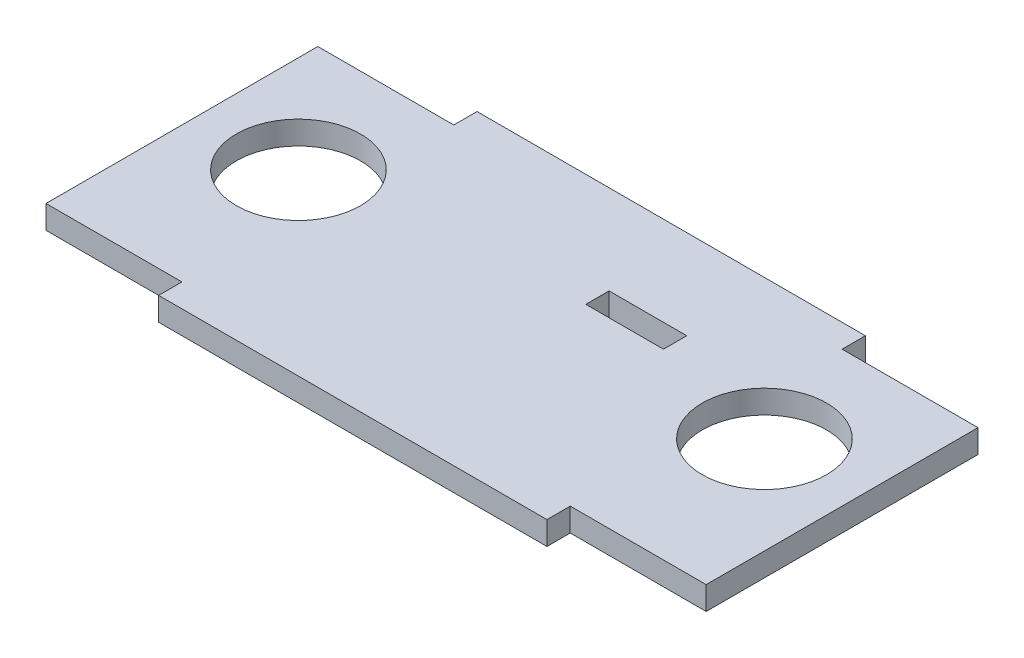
ISO-10303-21;
HEADER;
FILE_DESCRIPTION(('STEP AP214'),'2;1');
FILE_NAME('part.step','',(''),(''),'','','');
FILE_SCHEMA(('AUTOMOTIVE_DESIGN { 1 0 10303 214 1 1 1 1 }'));
ENDSEC;
DATA;
#1=APPLICATION_CONTEXT('core data for automotive mechanical design processes');
#2=APPLICATION_PROTOCOL_DEFINITION('international standard','automotive_design',2000,#1);
#3=PRODUCT_CONTEXT('',#1,'mechanical');
#4=PRODUCT('Part','Part','',(#3));
#5=PRODUCT_RELATED_PRODUCT_CATEGORY('part','',(#4));
#6=PRODUCT_DEFINITION_FORMATION('','',#4);
#7=PRODUCT_DEFINITION_CONTEXT('part definition',#1,'design');
#8=PRODUCT_DEFINITION('design','',#6,#7);
#9=PRODUCT_DEFINITION_SHAPE('','',#8);
#10=(LENGTH_UNIT() NAMED_UNIT(*) SI_UNIT(.MILLI.,.METRE.));
#11=(NAMED_UNIT(*) PLANE_ANGLE_UNIT() SI_UNIT($,.RADIAN.));
#12=(NAMED_UNIT(*) SI_UNIT($,.STERADIAN.) SOLID_ANGLE_UNIT());
#13=UNCERTAINTY_MEASURE_WITH_UNIT(LENGTH_MEASURE(1.E-05),#10,'distance_accuracy_value','');
#14=(GEOMETRIC_REPRESENTATION_CONTEXT(3) GLOBAL_UNCERTAINTY_ASSIGNED_CONTEXT((#13)) GLOBAL_UNIT_ASSIGNED_CONTEXT((#10,
#11,#12)) REPRESENTATION_CONTEXT('',''));
#15=CARTESIAN_POINT('',(0.,0.,0.));
#16=DIRECTION('',(0.,0.,1.));
#17=DIRECTION('',(1.,0.,0.));
#18=AXIS2_PLACEMENT_3D('',#15,#16,#17);
#19=CARTESIAN_POINT('',(0.,3.,0.));
#20=DIRECTION('',(0.,1.,0.));
#21=DIRECTION('',(0.,0.,1.));
#22=AXIS2_PLACEMENT_3D('',#19,#20,#21);
#23=PLANE('',#22);
#24=DIRECTION('',(0.,0.,-1.));
#25=VECTOR('',#24,1.);
#26=CARTESIAN_POINT('',(13.5,3.,-13.5));
#27=LINE('',#26,#25);
#28=CARTESIAN_POINT('',(13.5,3.,-10.5));
#29=VERTEX_POINT('',#28);
#30=CARTESIAN_POINT('',(13.5,3.,-13.5));
#31=VERTEX_POINT('',#30);
#32=EDGE_CURVE('E211',#29,#31,#27,.T.);
#33=ORIENTED_EDGE('',*,*,#32,.F.);
#34=DIRECTION('',(1.,0.,0.));
#35=VECTOR('',#34,1.);
#36=CARTESIAN_POINT('',(3.5,3.,-10.5));
#37=LINE('',#36,#35);
#38=CARTESIAN_POINT('',(3.5,3.,-10.5));
#39=VERTEX_POINT('',#38);
#40=EDGE_CURVE('E201',#39,#29,#37,.T.);
#41=ORIENTED_EDGE('',*,*,#40,.F.);
#42=DIRECTION('',(0.,0.,1.));
#43=VECTOR('',#42,1.);
#44=CARTESIAN_POINT('',(3.5,3.,-13.5));
#45=LINE('',#44,#43);
#46=CARTESIAN_POINT('',(3.5,3.,-13.5));
#47=VERTEX_POINT('',#46);
#48=EDGE_CURVE('E205',#47,#39,#45,.T.);
#49=ORIENTED_EDGE('',*,*,#48,.F.);
#50=DIRECTION('',(-1.,0.,0.));
#51=VECTOR('',#50,1.);
#52=CARTESIAN_POINT('',(3.5,3.,-13.5));
#53=LINE('',#52,#51);
#54=EDGE_CURVE('E208',#31,#47,#53,.T.);
#55=ORIENTED_EDGE('',*,*,#54,.F.);
#56=EDGE_LOOP('',(#33,#41,#49,#55));
#57=FACE_BOUND('',#56,.T.);
#58=CARTESIAN_POINT('',(-30.,3.,-7.00000000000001));
#59=DIRECTION('',(0.,1.,0.));
#60=DIRECTION('',(0.,0.,1.));
#61=AXIS2_PLACEMENT_3D('',#58,#59,#60);
#62=CIRCLE('',#61,8.);
#63=CARTESIAN_POINT('',(-30.,3.,0.999999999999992));
#64=VERTEX_POINT('',#63);
#65=EDGE_CURVE('E175',#64,#64,#62,.T.);
#66=ORIENTED_EDGE('',*,*,#65,.F.);
#67=EDGE_LOOP('',(#66));
#68=FACE_BOUND('',#67,.T.);
#69=CARTESIAN_POINT('',(30.,3.,-7.00000000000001));
#70=DIRECTION('',(0.,1.,0.));
#71=DIRECTION('',(0.,0.,1.));
#72=AXIS2_PLACEMENT_3D('',#69,#70,#71);
#73=CIRCLE('',#72,8.);
#74=CARTESIAN_POINT('',(30.,3.,0.999999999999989));
#75=VERTEX_POINT('',#74);
#76=EDGE_CURVE('E183',#75,#75,#73,.T.);
#77=ORIENTED_EDGE('',*,*,#76,.F.);
#78=EDGE_LOOP('',(#77));
#79=FACE_BOUND('',#78,.T.);
#80=DIRECTION('',(-1.,0.,0.));
#81=VECTOR('',#80,1.);
#82=CARTESIAN_POINT('',(0.,3.,16.));
#83=LINE('',#82,#81);
#84=CARTESIAN_POINT('',(25.,3.,16.));
#85=VERTEX_POINT('',#84);
#86=CARTESIAN_POINT('',(-25.,3.,16.));
#87=VERTEX_POINT('',#86);
#88=EDGE_CURVE('E188',#85,#87,#83,.T.);
#89=ORIENTED_EDGE('',*,*,#88,.F.);
#90=DIRECTION('',(0.,0.,-1.));
#91=VECTOR('',#90,1.);
#92=CARTESIAN_POINT('',(25.,3.,16.));
#93=LINE('',#92,#91);
#94=CARTESIAN_POINT('',(25.,3.,13.));
#95=VERTEX_POINT('',#94);
#96=EDGE_CURVE('E50',#85,#95,#93,.T.);
#97=ORIENTED_EDGE('',*,*,#96,.T.);
#98=DIRECTION('',(1.,0.,0.));
#99=VECTOR('',#98,1.);
#100=CARTESIAN_POINT('',(42.5,3.,13.));
#101=LINE('',#100,#99);
#102=CARTESIAN_POINT('',(42.5,3.,13.));
#103=VERTEX_POINT('',#102);
#104=EDGE_CURVE('E279',#95,#103,#101,.T.);
#105=ORIENTED_EDGE('',*,*,#104,.T.);
#106=DIRECTION('',(0.,0.,-1.));
#107=VECTOR('',#106,1.);
#108=CARTESIAN_POINT('',(42.5,3.,-25.));
#109=LINE('',#108,#107);
#110=CARTESIAN_POINT('',(42.5,3.,-22.));
#111=VERTEX_POINT('',#110);
#112=EDGE_CURVE('E165',#103,#111,#109,.T.);
#113=ORIENTED_EDGE('',*,*,#112,.T.);
#114=DIRECTION('',(-1.,0.,0.));
#115=VECTOR('',#114,1.);
#116=CARTESIAN_POINT('',(42.5,3.,-22.));
#117=LINE('',#116,#115);
#118=CARTESIAN_POINT('',(25.,3.,-22.));
#119=VERTEX_POINT('',#118);
#120=EDGE_CURVE('E248',#111,#119,#117,.T.);
#121=ORIENTED_EDGE('',*,*,#120,.T.);
#122=DIRECTION('',(0.,0.,-1.));
#123=VECTOR('',#122,1.);
#124=CARTESIAN_POINT('',(25.,3.,-25.));
#125=LINE('',#124,#123);
#126=CARTESIAN_POINT('',(25.,3.,-25.));
#127=VERTEX_POINT('',#126);
#128=EDGE_CURVE('E252',#119,#127,#125,.T.);
#129=ORIENTED_EDGE('',*,*,#128,.T.);
#130=DIRECTION('',(-1.,0.,0.));
#131=VECTOR('',#130,1.);
#132=CARTESIAN_POINT('',(-42.5,3.,-25.));
#133=LINE('',#132,#131);
#134=CARTESIAN_POINT('',(-25.,3.,-25.));
#135=VERTEX_POINT('',#134);
#136=EDGE_CURVE('E42',#127,#135,#133,.T.);
#137=ORIENTED_EDGE('',*,*,#136,.T.);
#138=DIRECTION('',(0.,0.,-1.));
#139=VECTOR('',#138,1.);
#140=CARTESIAN_POINT('',(-25.,3.,-25.));
#141=LINE('',#140,#139);
#142=CARTESIAN_POINT('',(-25.,3.,-22.));
#143=VERTEX_POINT('',#142);
#144=EDGE_CURVE('E231',#143,#135,#141,.T.);
#145=ORIENTED_EDGE('',*,*,#144,.F.);
#146=DIRECTION('',(1.,0.,0.));
#147=VECTOR('',#146,1.);
#148=CARTESIAN_POINT('',(-42.5,3.,-22.));
#149=LINE('',#148,#147);
#150=CARTESIAN_POINT('',(-42.5,3.,-22.));
#151=VERTEX_POINT('',#150);
#152=EDGE_CURVE('E235',#151,#143,#149,.T.);
#153=ORIENTED_EDGE('',*,*,#152,.F.);
#154=DIRECTION('',(0.,0.,1.));
#155=VECTOR('',#154,1.);
#156=CARTESIAN_POINT('',(-42.5,3.,-25.));
#157=LINE('',#156,#155);
#158=CARTESIAN_POINT('',(-42.5,3.,13.));
#159=VERTEX_POINT('',#158);
#160=EDGE_CURVE('E11',#151,#159,#157,.T.);
#161=ORIENTED_EDGE('',*,*,#160,.T.);
#162=DIRECTION('',(-1.,0.,0.));
#163=VECTOR('',#162,1.);
#164=CARTESIAN_POINT('',(-42.5,3.,13.));
#165=LINE('',#164,#163);
#166=CARTESIAN_POINT('',(-25.,3.,13.));
#167=VERTEX_POINT('',#166);
#168=EDGE_CURVE('E266',#167,#159,#165,.T.);
#169=ORIENTED_EDGE('',*,*,#168,.F.);
#170=DIRECTION('',(0.,0.,-1.));
#171=VECTOR('',#170,1.);
#172=CARTESIAN_POINT('',(-25.,3.,16.));
#173=LINE('',#172,#171);
#174=EDGE_CURVE('E269',#87,#167,#173,.T.);
#175=ORIENTED_EDGE('',*,*,#174,.F.);
#176=EDGE_LOOP('',(#89,#97,#105,#113,#121,#129,#137,#145,#153,#161,#169,#175));
#177=FACE_BOUND('',#176,.T.);
#178=ADVANCED_FACE('F33',(#57,#68,#79,#177),#23,.T.);
#179=CARTESIAN_POINT('',(0.,0.,0.));
#180=DIRECTION('',(0.,1.,0.));
#181=DIRECTION('',(0.,0.,1.));
#182=AXIS2_PLACEMENT_3D('',#179,#180,#181);
#183=PLANE('',#182);
#184=DIRECTION('',(1.,0.,0.));
#185=VECTOR('',#184,1.);
#186=CARTESIAN_POINT('',(3.5,0.,-10.5));
#187=LINE('',#186,#185);
#188=CARTESIAN_POINT('',(3.5,0.,-10.5));
#189=VERTEX_POINT('',#188);
#190=CARTESIAN_POINT('',(13.5,0.,-10.5));
#191=VERTEX_POINT('',#190);
#192=EDGE_CURVE('E196',#189,#191,#187,.T.);
#193=ORIENTED_EDGE('',*,*,#192,.T.);
#194=DIRECTION('',(0.,0.,-1.));
#195=VECTOR('',#194,1.);
#196=CARTESIAN_POINT('',(13.5,0.,-13.5));
#197=LINE('',#196,#195);
#198=CARTESIAN_POINT('',(13.5,0.,-13.5));
#199=VERTEX_POINT('',#198);
#200=EDGE_CURVE('E204',#191,#199,#197,.T.);
#201=ORIENTED_EDGE('',*,*,#200,.T.);
#202=DIRECTION('',(-1.,0.,0.));
#203=VECTOR('',#202,1.);
#204=CARTESIAN_POINT('',(3.5,0.,-13.5));
#205=LINE('',#204,#203);
#206=CARTESIAN_POINT('',(3.5,0.,-13.5));
#207=VERTEX_POINT('',#206);
#208=EDGE_CURVE('E219',#199,#207,#205,.T.);
#209=ORIENTED_EDGE('',*,*,#208,.T.);
#210=DIRECTION('',(0.,0.,1.));
#211=VECTOR('',#210,1.);
#212=CARTESIAN_POINT('',(3.5,0.,-13.5));
#213=LINE('',#212,#211);
#214=EDGE_CURVE('E216',#207,#189,#213,.T.);
#215=ORIENTED_EDGE('',*,*,#214,.T.);
#216=EDGE_LOOP('',(#193,#201,#209,#215));
#217=FACE_BOUND('',#216,.T.);
#218=CARTESIAN_POINT('',(-30.,0.,-7.00000000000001));
#219=DIRECTION('',(0.,1.,0.));
#220=DIRECTION('',(0.,0.,1.));
#221=AXIS2_PLACEMENT_3D('',#218,#219,#220);
#222=CIRCLE('',#221,8.);
#223=CARTESIAN_POINT('',(-30.,0.,0.999999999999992));
#224=VERTEX_POINT('',#223);
#225=EDGE_CURVE('E172',#224,#224,#222,.T.);
#226=ORIENTED_EDGE('',*,*,#225,.T.);
#227=EDGE_LOOP('',(#226));
#228=FACE_BOUND('',#227,.T.);
#229=CARTESIAN_POINT('',(30.,0.,-7.00000000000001));
#230=DIRECTION('',(0.,1.,0.));
#231=DIRECTION('',(0.,0.,1.));
#232=AXIS2_PLACEMENT_3D('',#229,#230,#231);
#233=CIRCLE('',#232,8.);
#234=CARTESIAN_POINT('',(30.,0.,0.999999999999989));
#235=VERTEX_POINT('',#234);
#236=EDGE_CURVE('E181',#235,#235,#233,.T.);
#237=ORIENTED_EDGE('',*,*,#236,.T.);
#238=EDGE_LOOP('',(#237));
#239=FACE_BOUND('',#238,.T.);
#240=DIRECTION('',(0.,0.,-1.));
#241=VECTOR('',#240,1.);
#242=CARTESIAN_POINT('',(25.,0.,16.));
#243=LINE('',#242,#241);
#244=CARTESIAN_POINT('',(25.,0.,16.));
#245=VERTEX_POINT('',#244);
#246=CARTESIAN_POINT('',(25.,0.,13.));
#247=VERTEX_POINT('',#246);
#248=EDGE_CURVE('E158',#245,#247,#243,.T.);
#249=ORIENTED_EDGE('',*,*,#248,.F.);
#250=DIRECTION('',(-1.,0.,0.));
#251=VECTOR('',#250,1.);
#252=CARTESIAN_POINT('',(0.,0.,16.));
#253=LINE('',#252,#251);
#254=CARTESIAN_POINT('',(-25.,0.,16.));
#255=VERTEX_POINT('',#254);
#256=EDGE_CURVE('E58',#245,#255,#253,.T.);
#257=ORIENTED_EDGE('',*,*,#256,.T.);
#258=DIRECTION('',(0.,0.,-1.));
#259=VECTOR('',#258,1.);
#260=CARTESIAN_POINT('',(-25.,0.,16.));
#261=LINE('',#260,#259);
#262=CARTESIAN_POINT('',(-25.,0.,13.));
#263=VERTEX_POINT('',#262);
#264=EDGE_CURVE('E268',#255,#263,#261,.T.);
#265=ORIENTED_EDGE('',*,*,#264,.T.);
#266=DIRECTION('',(-1.,0.,0.));
#267=VECTOR('',#266,1.);
#268=CARTESIAN_POINT('',(-42.5,0.,13.));
#269=LINE('',#268,#267);
#270=CARTESIAN_POINT('',(-42.5,0.,13.));
#271=VERTEX_POINT('',#270);
#272=EDGE_CURVE('E262',#263,#271,#269,.T.);
#273=ORIENTED_EDGE('',*,*,#272,.T.);
#274=DIRECTION('',(0.,0.,1.));
#275=VECTOR('',#274,1.);
#276=CARTESIAN_POINT('',(-42.5,0.,-25.));
#277=LINE('',#276,#275);
#278=CARTESIAN_POINT('',(-42.5,0.,-22.));
#279=VERTEX_POINT('',#278);
#280=EDGE_CURVE('E37',#279,#271,#277,.T.);
#281=ORIENTED_EDGE('',*,*,#280,.F.);
#282=DIRECTION('',(1.,0.,0.));
#283=VECTOR('',#282,1.);
#284=CARTESIAN_POINT('',(-42.5,0.,-22.));
#285=LINE('',#284,#283);
#286=CARTESIAN_POINT('',(-25.,0.,-22.));
#287=VERTEX_POINT('',#286);
#288=EDGE_CURVE('E234',#279,#287,#285,.T.);
#289=ORIENTED_EDGE('',*,*,#288,.T.);
#290=DIRECTION('',(0.,0.,-1.));
#291=VECTOR('',#290,1.);
#292=CARTESIAN_POINT('',(-25.,0.,-25.));
#293=LINE('',#292,#291);
#294=CARTESIAN_POINT('',(-25.,0.,-25.));
#295=VERTEX_POINT('',#294);
#296=EDGE_CURVE('E227',#287,#295,#293,.T.);
#297=ORIENTED_EDGE('',*,*,#296,.T.);
#298=DIRECTION('',(-1.,0.,0.));
#299=VECTOR('',#298,1.);
#300=CARTESIAN_POINT('',(-42.5,0.,-25.));
#301=LINE('',#300,#299);
#302=CARTESIAN_POINT('',(25.,0.,-25.));
#303=VERTEX_POINT('',#302);
#304=EDGE_CURVE('E171',#303,#295,#301,.T.);
#305=ORIENTED_EDGE('',*,*,#304,.F.);
#306=DIRECTION('',(0.,0.,-1.));
#307=VECTOR('',#306,1.);
#308=CARTESIAN_POINT('',(25.,0.,-25.));
#309=LINE('',#308,#307);
#310=CARTESIAN_POINT('',(25.,0.,-22.));
#311=VERTEX_POINT('',#310);
#312=EDGE_CURVE('E251',#311,#303,#309,.T.);
#313=ORIENTED_EDGE('',*,*,#312,.F.);
#314=DIRECTION('',(-1.,0.,0.));
#315=VECTOR('',#314,1.);
#316=CARTESIAN_POINT('',(42.5,0.,-22.));
#317=LINE('',#316,#315);
#318=CARTESIAN_POINT('',(42.5,0.,-22.));
#319=VERTEX_POINT('',#318);
#320=EDGE_CURVE('E170',#319,#311,#317,.T.);
#321=ORIENTED_EDGE('',*,*,#320,.F.);
#322=DIRECTION('',(0.,0.,-1.));
#323=VECTOR('',#322,1.);
#324=CARTESIAN_POINT('',(42.5,0.,-25.));
#325=LINE('',#324,#323);
#326=CARTESIAN_POINT('',(42.5,0.,13.));
#327=VERTEX_POINT('',#326);
#328=EDGE_CURVE('E163',#327,#319,#325,.T.);
#329=ORIENTED_EDGE('',*,*,#328,.F.);
#330=DIRECTION('',(1.,0.,0.));
#331=VECTOR('',#330,1.);
#332=CARTESIAN_POINT('',(42.5,0.,13.));
#333=LINE('',#332,#331);
#334=EDGE_CURVE('E150',#247,#327,#333,.T.);
#335=ORIENTED_EDGE('',*,*,#334,.F.);
#336=EDGE_LOOP('',(#249,#257,#265,#273,#281,#289,#297,#305,#313,#321,#329,#335));
#337=FACE_BOUND('',#336,.T.);
#338=ADVANCED_FACE('F168',(#217,#228,#239,#337),#183,.F.);
#339=CARTESIAN_POINT('',(42.5,3.,-25.));
#340=DIRECTION('',(-1.,0.,0.));
#341=DIRECTION('',(0.,0.,1.));
#342=AXIS2_PLACEMENT_3D('',#339,#340,#341);
#343=PLANE('',#342);
#344=DIRECTION('',(0.,1.,0.));
#345=VECTOR('',#344,1.);
#346=CARTESIAN_POINT('',(42.5,0.,13.));
#347=LINE('',#346,#345);
#348=EDGE_CURVE('E154',#327,#103,#347,.T.);
#349=ORIENTED_EDGE('',*,*,#348,.F.);
#350=ORIENTED_EDGE('',*,*,#328,.T.);
#351=DIRECTION('',(0.,1.,0.));
#352=VECTOR('',#351,1.);
#353=CARTESIAN_POINT('',(42.5,0.,-22.));
#354=LINE('',#353,#352);
#355=EDGE_CURVE('E238',#319,#111,#354,.T.);
#356=ORIENTED_EDGE('',*,*,#355,.T.);
#357=ORIENTED_EDGE('',*,*,#112,.F.);
#358=EDGE_LOOP('',(#349,#350,#356,#357));
#359=FACE_BOUND('',#358,.T.);
#360=ADVANCED_FACE('F35',(#359),#343,.F.);
#361=CARTESIAN_POINT('',(0.,0.,16.));
#362=DIRECTION('',(0.,0.,-1.));
#363=DIRECTION('',(-1.,0.,0.));
#364=AXIS2_PLACEMENT_3D('',#361,#362,#363);
#365=PLANE('',#364);
#366=DIRECTION('',(0.,1.,0.));
#367=VECTOR('',#366,1.);
#368=CARTESIAN_POINT('',(25.,0.,16.));
#369=LINE('',#368,#367);
#370=EDGE_CURVE('E272',#245,#85,#369,.T.);
#371=ORIENTED_EDGE('',*,*,#370,.T.);
#372=ORIENTED_EDGE('',*,*,#88,.T.);
#373=DIRECTION('',(0.,1.,0.));
#374=VECTOR('',#373,1.);
#375=CARTESIAN_POINT('',(-25.,0.,16.));
#376=LINE('',#375,#374);
#377=EDGE_CURVE('E258',#255,#87,#376,.T.);
#378=ORIENTED_EDGE('',*,*,#377,.F.);
#379=ORIENTED_EDGE('',*,*,#256,.F.);
#380=EDGE_LOOP('',(#371,#372,#378,#379));
#381=FACE_BOUND('',#380,.T.);
#382=ADVANCED_FACE('F284',(#381),#365,.F.);
#383=CARTESIAN_POINT('',(-42.5,3.,-25.));
#384=DIRECTION('',(0.,0.,1.));
#385=DIRECTION('',(1.,0.,0.));
#386=AXIS2_PLACEMENT_3D('',#383,#384,#385);
#387=PLANE('',#386);
#388=DIRECTION('',(0.,1.,0.));
#389=VECTOR('',#388,1.);
#390=CARTESIAN_POINT('',(25.,0.,-25.));
#391=LINE('',#390,#389);
#392=EDGE_CURVE('E243',#303,#127,#391,.T.);
#393=ORIENTED_EDGE('',*,*,#392,.F.);
#394=ORIENTED_EDGE('',*,*,#304,.T.);
#395=DIRECTION('',(0.,1.,0.));
#396=VECTOR('',#395,1.);
#397=CARTESIAN_POINT('',(-25.,0.,-25.));
#398=LINE('',#397,#396);
#399=EDGE_CURVE('E213',#295,#135,#398,.T.);
#400=ORIENTED_EDGE('',*,*,#399,.T.);
#401=ORIENTED_EDGE('',*,*,#136,.F.);
#402=EDGE_LOOP('',(#393,#394,#400,#401));
#403=FACE_BOUND('',#402,.T.);
#404=ADVANCED_FACE('F312',(#403),#387,.F.);
#405=CARTESIAN_POINT('',(-42.5,3.,-25.));
#406=DIRECTION('',(1.,0.,0.));
#407=DIRECTION('',(0.,0.,-1.));
#408=AXIS2_PLACEMENT_3D('',#405,#406,#407);
#409=PLANE('',#408);
#410=ORIENTED_EDGE('',*,*,#280,.T.);
#411=DIRECTION('',(0.,1.,0.));
#412=VECTOR('',#411,1.);
#413=CARTESIAN_POINT('',(-42.5,0.,13.));
#414=LINE('',#413,#412);
#415=EDGE_CURVE('E255',#271,#159,#414,.T.);
#416=ORIENTED_EDGE('',*,*,#415,.T.);
#417=ORIENTED_EDGE('',*,*,#160,.F.);
#418=DIRECTION('',(0.,1.,0.));
#419=VECTOR('',#418,1.);
#420=CARTESIAN_POINT('',(-42.5,0.,-22.));
#421=LINE('',#420,#419);
#422=EDGE_CURVE('E224',#279,#151,#421,.T.);
#423=ORIENTED_EDGE('',*,*,#422,.F.);
#424=EDGE_LOOP('',(#410,#416,#417,#423));
#425=FACE_BOUND('',#424,.T.);
#426=ADVANCED_FACE('F298',(#425),#409,.F.);
#427=CARTESIAN_POINT('',(-30.,0.,-7.00000000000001));
#428=DIRECTION('',(0.,1.,0.));
#429=DIRECTION('',(0.,0.,1.));
#430=AXIS2_PLACEMENT_3D('',#427,#428,#429);
#431=CYLINDRICAL_SURFACE('',#430,8.);
#432=ORIENTED_EDGE('',*,*,#225,.F.);
#433=EDGE_LOOP('',(#432));
#434=FACE_BOUND('',#433,.T.);
#435=ORIENTED_EDGE('',*,*,#65,.T.);
#436=EDGE_LOOP('',(#435));
#437=FACE_BOUND('',#436,.T.);
#438=ADVANCED_FACE('F340',(#434,#437),#431,.F.);
#439=CARTESIAN_POINT('',(30.,0.,-7.00000000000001));
#440=DIRECTION('',(0.,1.,0.));
#441=DIRECTION('',(0.,0.,1.));
#442=AXIS2_PLACEMENT_3D('',#439,#440,#441);
#443=CYLINDRICAL_SURFACE('',#442,8.);
#444=ORIENTED_EDGE('',*,*,#236,.F.);
#445=EDGE_LOOP('',(#444));
#446=FACE_BOUND('',#445,.T.);
#447=ORIENTED_EDGE('',*,*,#76,.T.);
#448=EDGE_LOOP('',(#447));
#449=FACE_BOUND('',#448,.T.);
#450=ADVANCED_FACE('F355',(#446,#449),#443,.F.);
#451=CARTESIAN_POINT('',(13.5,0.,-13.5));
#452=DIRECTION('',(1.,0.,0.));
#453=DIRECTION('',(0.,0.,-1.));
#454=AXIS2_PLACEMENT_3D('',#451,#452,#453);
#455=PLANE('',#454);
#456=ORIENTED_EDGE('',*,*,#32,.T.);
#457=DIRECTION('',(0.,1.,0.));
#458=VECTOR('',#457,1.);
#459=CARTESIAN_POINT('',(13.5,0.,-13.5));
#460=LINE('',#459,#458);
#461=EDGE_CURVE('E192',#199,#31,#460,.T.);
#462=ORIENTED_EDGE('',*,*,#461,.F.);
#463=ORIENTED_EDGE('',*,*,#200,.F.);
#464=DIRECTION('',(0.,1.,0.));
#465=VECTOR('',#464,1.);
#466=CARTESIAN_POINT('',(13.5,0.,-10.5));
#467=LINE('',#466,#465);
#468=EDGE_CURVE('E190',#191,#29,#467,.T.);
#469=ORIENTED_EDGE('',*,*,#468,.T.);
#470=EDGE_LOOP('',(#456,#462,#463,#469));
#471=FACE_BOUND('',#470,.T.);
#472=ADVANCED_FACE('F353',(#471),#455,.F.);
#473=CARTESIAN_POINT('',(3.5,0.,-10.5));
#474=DIRECTION('',(0.,0.,1.));
#475=DIRECTION('',(1.,0.,0.));
#476=AXIS2_PLACEMENT_3D('',#473,#474,#475);
#477=PLANE('',#476);
#478=ORIENTED_EDGE('',*,*,#40,.T.);
#479=ORIENTED_EDGE('',*,*,#468,.F.);
#480=ORIENTED_EDGE('',*,*,#192,.F.);
#481=DIRECTION('',(0.,1.,0.));
#482=VECTOR('',#481,1.);
#483=CARTESIAN_POINT('',(3.5,0.,-10.5));
#484=LINE('',#483,#482);
#485=EDGE_CURVE('E198',#189,#39,#484,.T.);
#486=ORIENTED_EDGE('',*,*,#485,.T.);
#487=EDGE_LOOP('',(#478,#479,#480,#486));
#488=FACE_BOUND('',#487,.T.);
#489=ADVANCED_FACE('F362',(#488),#477,.F.);
#490=CARTESIAN_POINT('',(3.5,0.,-13.5));
#491=DIRECTION('',(-1.,0.,0.));
#492=DIRECTION('',(0.,0.,1.));
#493=AXIS2_PLACEMENT_3D('',#490,#491,#492);
#494=PLANE('',#493);
#495=ORIENTED_EDGE('',*,*,#48,.T.);
#496=ORIENTED_EDGE('',*,*,#485,.F.);
#497=ORIENTED_EDGE('',*,*,#214,.F.);
#498=DIRECTION('',(0.,1.,0.));
#499=VECTOR('',#498,1.);
#500=CARTESIAN_POINT('',(3.5,0.,-13.5));
#501=LINE('',#500,#499);
#502=EDGE_CURVE('E195',#207,#47,#501,.T.);
#503=ORIENTED_EDGE('',*,*,#502,.T.);
#504=EDGE_LOOP('',(#495,#496,#497,#503));
#505=FACE_BOUND('',#504,.T.);
#506=ADVANCED_FACE('F480',(#505),#494,.F.);
#507=CARTESIAN_POINT('',(3.5,0.,-13.5));
#508=DIRECTION('',(0.,0.,-1.));
#509=DIRECTION('',(-1.,0.,0.));
#510=AXIS2_PLACEMENT_3D('',#507,#508,#509);
#511=PLANE('',#510);
#512=ORIENTED_EDGE('',*,*,#54,.T.);
#513=ORIENTED_EDGE('',*,*,#502,.F.);
#514=ORIENTED_EDGE('',*,*,#208,.F.);
#515=ORIENTED_EDGE('',*,*,#461,.T.);
#516=EDGE_LOOP('',(#512,#513,#514,#515));
#517=FACE_BOUND('',#516,.T.);
#518=ADVANCED_FACE('F472',(#517),#511,.F.);
#519=CARTESIAN_POINT('',(-25.,0.,-25.));
#520=DIRECTION('',(1.,0.,0.));
#521=DIRECTION('',(0.,0.,-1.));
#522=AXIS2_PLACEMENT_3D('',#519,#520,#521);
#523=PLANE('',#522);
#524=ORIENTED_EDGE('',*,*,#144,.T.);
#525=ORIENTED_EDGE('',*,*,#399,.F.);
#526=ORIENTED_EDGE('',*,*,#296,.F.);
#527=DIRECTION('',(0.,1.,0.));
#528=VECTOR('',#527,1.);
#529=CARTESIAN_POINT('',(-25.,0.,-22.));
#530=LINE('',#529,#528);
#531=EDGE_CURVE('E226',#287,#143,#530,.T.);
#532=ORIENTED_EDGE('',*,*,#531,.T.);
#533=EDGE_LOOP('',(#524,#525,#526,#532));
#534=FACE_BOUND('',#533,.T.);
#535=ADVANCED_FACE('F308',(#534),#523,.F.);
#536=CARTESIAN_POINT('',(-42.5,0.,-22.));
#537=DIRECTION('',(0.,0.,1.));
#538=DIRECTION('',(1.,0.,0.));
#539=AXIS2_PLACEMENT_3D('',#536,#537,#538);
#540=PLANE('',#539);
#541=ORIENTED_EDGE('',*,*,#152,.T.);
#542=ORIENTED_EDGE('',*,*,#531,.F.);
#543=ORIENTED_EDGE('',*,*,#288,.F.);
#544=ORIENTED_EDGE('',*,*,#422,.T.);
#545=EDGE_LOOP('',(#541,#542,#543,#544));
#546=FACE_BOUND('',#545,.T.);
#547=ADVANCED_FACE('F304',(#546),#540,.F.);
#548=CARTESIAN_POINT('',(42.5,0.,-22.));
#549=DIRECTION('',(0.,0.,-1.));
#550=DIRECTION('',(-1.,0.,0.));
#551=AXIS2_PLACEMENT_3D('',#548,#549,#550);
#552=PLANE('',#551);
#553=ORIENTED_EDGE('',*,*,#120,.F.);
#554=ORIENTED_EDGE('',*,*,#355,.F.);
#555=ORIENTED_EDGE('',*,*,#320,.T.);
#556=DIRECTION('',(0.,1.,0.));
#557=VECTOR('',#556,1.);
#558=CARTESIAN_POINT('',(25.,0.,-22.));
#559=LINE('',#558,#557);
#560=EDGE_CURVE('E245',#311,#119,#559,.T.);
#561=ORIENTED_EDGE('',*,*,#560,.T.);
#562=EDGE_LOOP('',(#553,#554,#555,#561));
#563=FACE_BOUND('',#562,.T.);
#564=ADVANCED_FACE('F319',(#563),#552,.T.);
#565=CARTESIAN_POINT('',(25.,0.,-25.));
#566=DIRECTION('',(1.,0.,0.));
#567=DIRECTION('',(0.,0.,-1.));
#568=AXIS2_PLACEMENT_3D('',#565,#566,#567);
#569=PLANE('',#568);
#570=ORIENTED_EDGE('',*,*,#128,.F.);
#571=ORIENTED_EDGE('',*,*,#560,.F.);
#572=ORIENTED_EDGE('',*,*,#312,.T.);
#573=ORIENTED_EDGE('',*,*,#392,.T.);
#574=EDGE_LOOP('',(#570,#571,#572,#573));
#575=FACE_BOUND('',#574,.T.);
#576=ADVANCED_FACE('F316',(#575),#569,.T.);
#577=CARTESIAN_POINT('',(-42.5,0.,13.));
#578=DIRECTION('',(0.,0.,-1.));
#579=DIRECTION('',(-1.,0.,0.));
#580=AXIS2_PLACEMENT_3D('',#577,#578,#579);
#581=PLANE('',#580);
#582=ORIENTED_EDGE('',*,*,#168,.T.);
#583=ORIENTED_EDGE('',*,*,#415,.F.);
#584=ORIENTED_EDGE('',*,*,#272,.F.);
#585=DIRECTION('',(0.,1.,0.));
#586=VECTOR('',#585,1.);
#587=CARTESIAN_POINT('',(-25.,0.,13.));
#588=LINE('',#587,#586);
#589=EDGE_CURVE('E261',#263,#167,#588,.T.);
#590=ORIENTED_EDGE('',*,*,#589,.T.);
#591=EDGE_LOOP('',(#582,#583,#584,#590));
#592=FACE_BOUND('',#591,.T.);
#593=ADVANCED_FACE('F294',(#592),#581,.F.);
#594=CARTESIAN_POINT('',(-25.,0.,16.));
#595=DIRECTION('',(1.,0.,0.));
#596=DIRECTION('',(0.,0.,-1.));
#597=AXIS2_PLACEMENT_3D('',#594,#595,#596);
#598=PLANE('',#597);
#599=ORIENTED_EDGE('',*,*,#174,.T.);
#600=ORIENTED_EDGE('',*,*,#589,.F.);
#601=ORIENTED_EDGE('',*,*,#264,.F.);
#602=ORIENTED_EDGE('',*,*,#377,.T.);
#603=EDGE_LOOP('',(#599,#600,#601,#602));
#604=FACE_BOUND('',#603,.T.);
#605=ADVANCED_FACE('F288',(#604),#598,.F.);
#606=CARTESIAN_POINT('',(25.,0.,16.));
#607=DIRECTION('',(1.,0.,0.));
#608=DIRECTION('',(0.,0.,-1.));
#609=AXIS2_PLACEMENT_3D('',#606,#607,#608);
#610=PLANE('',#609);
#611=ORIENTED_EDGE('',*,*,#96,.F.);
#612=ORIENTED_EDGE('',*,*,#370,.F.);
#613=ORIENTED_EDGE('',*,*,#248,.T.);
#614=DIRECTION('',(0.,1.,0.));
#615=VECTOR('',#614,1.);
#616=CARTESIAN_POINT('',(25.,0.,13.));
#617=LINE('',#616,#615);
#618=EDGE_CURVE('E156',#247,#95,#617,.T.);
#619=ORIENTED_EDGE('',*,*,#618,.T.);
#620=EDGE_LOOP('',(#611,#612,#613,#619));
#621=FACE_BOUND('',#620,.T.);
#622=ADVANCED_FACE('F281',(#621),#610,.T.);
#623=CARTESIAN_POINT('',(42.5,0.,13.));
#624=DIRECTION('',(0.,0.,1.));
#625=DIRECTION('',(1.,0.,0.));
#626=AXIS2_PLACEMENT_3D('',#623,#624,#625);
#627=PLANE('',#626);
#628=ORIENTED_EDGE('',*,*,#104,.F.);
#629=ORIENTED_EDGE('',*,*,#618,.F.);
#630=ORIENTED_EDGE('',*,*,#334,.T.);
#631=ORIENTED_EDGE('',*,*,#348,.T.);
#632=EDGE_LOOP('',(#628,#629,#630,#631));
#633=FACE_BOUND('',#632,.T.);
#634=ADVANCED_FACE('F153',(#633),#627,.T.);
#635=CLOSED_SHELL('',(#178,#338,#360,#382,#404,#426,#438,#450,#472,#489,#506,#518,#535,#547,
#564,#576,#593,#605,#622,#634));
#636=MANIFOLD_SOLID_BREP('B2',#635);
#637=ADVANCED_BREP_SHAPE_REPRESENTATION('',(#18,#636),#14);
#638=SHAPE_DEFINITION_REPRESENTATION(#9,#637);
ENDSEC;
END-ISO-10303-21;
